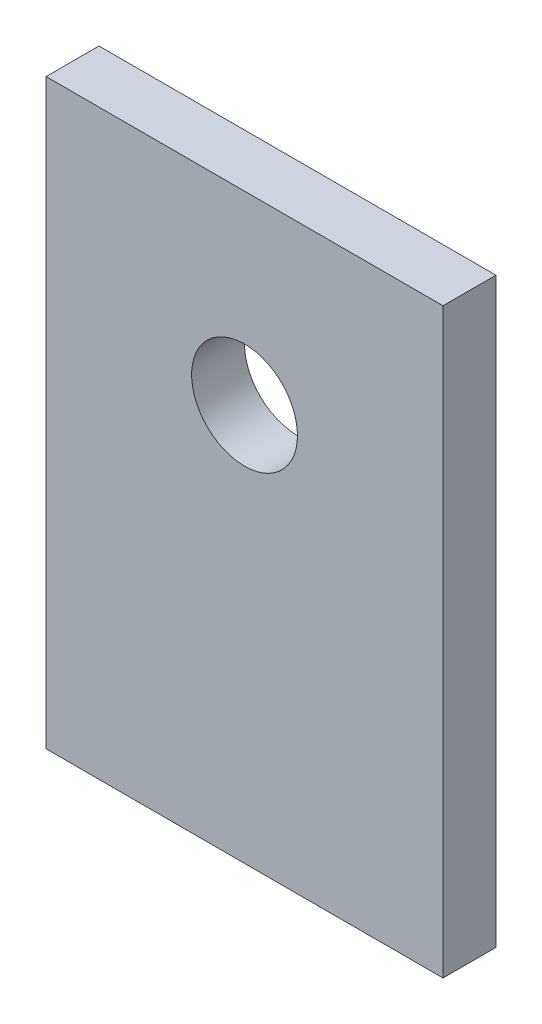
ISO-10303-21;
HEADER;
FILE_DESCRIPTION(('STEP AP214'),'2;1');
FILE_NAME('part.step','',(''),(''),'','','');
FILE_SCHEMA(('AUTOMOTIVE_DESIGN { 1 0 10303 214 1 1 1 1 }'));
ENDSEC;
DATA;
#1=APPLICATION_CONTEXT('core data for automotive mechanical design processes');
#2=APPLICATION_PROTOCOL_DEFINITION('international standard','automotive_design',2000,#1);
#3=PRODUCT_CONTEXT('',#1,'mechanical');
#4=PRODUCT('Part','Part','',(#3));
#5=PRODUCT_RELATED_PRODUCT_CATEGORY('part','',(#4));
#6=PRODUCT_DEFINITION_FORMATION('','',#4);
#7=PRODUCT_DEFINITION_CONTEXT('part definition',#1,'design');
#8=PRODUCT_DEFINITION('design','',#6,#7);
#9=PRODUCT_DEFINITION_SHAPE('','',#8);
#10=(LENGTH_UNIT() NAMED_UNIT(*) SI_UNIT(.MILLI.,.METRE.));
#11=(NAMED_UNIT(*) PLANE_ANGLE_UNIT() SI_UNIT($,.RADIAN.));
#12=(NAMED_UNIT(*) SI_UNIT($,.STERADIAN.) SOLID_ANGLE_UNIT());
#13=UNCERTAINTY_MEASURE_WITH_UNIT(LENGTH_MEASURE(1.E-05),#10,'distance_accuracy_value','');
#14=(GEOMETRIC_REPRESENTATION_CONTEXT(3) GLOBAL_UNCERTAINTY_ASSIGNED_CONTEXT((#13)) GLOBAL_UNIT_ASSIGNED_CONTEXT((#10,
#11,#12)) REPRESENTATION_CONTEXT('',''));
#15=CARTESIAN_POINT('',(0.,0.,0.));
#16=DIRECTION('',(0.,0.,1.));
#17=DIRECTION('',(1.,0.,0.));
#18=AXIS2_PLACEMENT_3D('',#15,#16,#17);
#19=CARTESIAN_POINT('',(0.,110.,20.));
#20=DIRECTION('',(0.,0.,1.));
#21=DIRECTION('',(1.,0.,0.));
#22=AXIS2_PLACEMENT_3D('',#19,#20,#21);
#23=PLANE('',#22);
#24=CARTESIAN_POINT('',(0.,150.,20.));
#25=DIRECTION('',(0.,0.,1.));
#26=DIRECTION('',(1.,0.,0.));
#27=AXIS2_PLACEMENT_3D('',#24,#25,#26);
#28=CIRCLE('',#27,20.);
#29=CARTESIAN_POINT('',(20.,150.,20.));
#30=VERTEX_POINT('',#29);
#31=EDGE_CURVE('E24',#30,#30,#28,.T.);
#32=ORIENTED_EDGE('',*,*,#31,.F.);
#33=EDGE_LOOP('',(#32));
#34=FACE_BOUND('',#33,.T.);
#35=DIRECTION('',(1.,0.,0.));
#36=VECTOR('',#35,1.);
#37=CARTESIAN_POINT('',(-75.,0.,20.));
#38=LINE('',#37,#36);
#39=CARTESIAN_POINT('',(-75.,0.,20.));
#40=VERTEX_POINT('',#39);
#41=CARTESIAN_POINT('',(75.,0.,20.));
#42=VERTEX_POINT('',#41);
#43=EDGE_CURVE('E96',#40,#42,#38,.T.);
#44=ORIENTED_EDGE('',*,*,#43,.T.);
#45=DIRECTION('',(0.,1.,0.));
#46=VECTOR('',#45,1.);
#47=CARTESIAN_POINT('',(75.,0.,20.));
#48=LINE('',#47,#46);
#49=CARTESIAN_POINT('',(75.,220.,20.));
#50=VERTEX_POINT('',#49);
#51=EDGE_CURVE('E112',#42,#50,#48,.T.);
#52=ORIENTED_EDGE('',*,*,#51,.T.);
#53=DIRECTION('',(-1.,0.,0.));
#54=VECTOR('',#53,1.);
#55=CARTESIAN_POINT('',(75.,220.,20.));
#56=LINE('',#55,#54);
#57=CARTESIAN_POINT('',(-75.,220.,20.));
#58=VERTEX_POINT('',#57);
#59=EDGE_CURVE('E88',#50,#58,#56,.T.);
#60=ORIENTED_EDGE('',*,*,#59,.T.);
#61=DIRECTION('',(0.,-1.,0.));
#62=VECTOR('',#61,1.);
#63=CARTESIAN_POINT('',(-75.,220.,20.));
#64=LINE('',#63,#62);
#65=EDGE_CURVE('E87',#58,#40,#64,.T.);
#66=ORIENTED_EDGE('',*,*,#65,.T.);
#67=EDGE_LOOP('',(#44,#52,#60,#66));
#68=FACE_BOUND('',#67,.T.);
#69=ADVANCED_FACE('F16',(#34,#68),#23,.T.);
#70=CARTESIAN_POINT('',(0.,110.,0.));
#71=DIRECTION('',(0.,0.,1.));
#72=DIRECTION('',(1.,0.,0.));
#73=AXIS2_PLACEMENT_3D('',#70,#71,#72);
#74=PLANE('',#73);
#75=CARTESIAN_POINT('',(0.,150.,0.));
#76=DIRECTION('',(0.,0.,1.));
#77=DIRECTION('',(1.,0.,0.));
#78=AXIS2_PLACEMENT_3D('',#75,#76,#77);
#79=CIRCLE('',#78,20.);
#80=CARTESIAN_POINT('',(20.,150.,0.));
#81=VERTEX_POINT('',#80);
#82=EDGE_CURVE('E10',#81,#81,#79,.T.);
#83=ORIENTED_EDGE('',*,*,#82,.T.);
#84=EDGE_LOOP('',(#83));
#85=FACE_BOUND('',#84,.T.);
#86=DIRECTION('',(0.,-1.,0.));
#87=VECTOR('',#86,1.);
#88=CARTESIAN_POINT('',(-75.,220.,0.));
#89=LINE('',#88,#87);
#90=CARTESIAN_POINT('',(-75.,220.,0.));
#91=VERTEX_POINT('',#90);
#92=CARTESIAN_POINT('',(-75.,0.,0.));
#93=VERTEX_POINT('',#92);
#94=EDGE_CURVE('E76',#91,#93,#89,.T.);
#95=ORIENTED_EDGE('',*,*,#94,.F.);
#96=DIRECTION('',(-1.,0.,0.));
#97=VECTOR('',#96,1.);
#98=CARTESIAN_POINT('',(75.,220.,0.));
#99=LINE('',#98,#97);
#100=CARTESIAN_POINT('',(75.,220.,0.));
#101=VERTEX_POINT('',#100);
#102=EDGE_CURVE('E111',#101,#91,#99,.T.);
#103=ORIENTED_EDGE('',*,*,#102,.F.);
#104=DIRECTION('',(0.,1.,0.));
#105=VECTOR('',#104,1.);
#106=CARTESIAN_POINT('',(75.,0.,0.));
#107=LINE('',#106,#105);
#108=CARTESIAN_POINT('',(75.,0.,0.));
#109=VERTEX_POINT('',#108);
#110=EDGE_CURVE('E98',#109,#101,#107,.T.);
#111=ORIENTED_EDGE('',*,*,#110,.F.);
#112=DIRECTION('',(1.,0.,0.));
#113=VECTOR('',#112,1.);
#114=CARTESIAN_POINT('',(-75.,0.,0.));
#115=LINE('',#114,#113);
#116=EDGE_CURVE('E94',#93,#109,#115,.T.);
#117=ORIENTED_EDGE('',*,*,#116,.F.);
#118=EDGE_LOOP('',(#95,#103,#111,#117));
#119=FACE_BOUND('',#118,.T.);
#120=ADVANCED_FACE('F100',(#85,#119),#74,.F.);
#121=CARTESIAN_POINT('',(0.,150.,0.));
#122=DIRECTION('',(0.,0.,-1.));
#123=DIRECTION('',(1.,0.,0.));
#124=AXIS2_PLACEMENT_3D('',#121,#122,#123);
#125=CYLINDRICAL_SURFACE('',#124,20.);
#126=DIRECTION('',(0.,0.,1.));
#127=VECTOR('',#126,1.);
#128=CARTESIAN_POINT('',(20.,150.,0.));
#129=LINE('',#128,#127);
#130=EDGE_CURVE('E117',#81,#30,#129,.T.);
#131=ORIENTED_EDGE('',*,*,#130,.T.);
#132=ORIENTED_EDGE('',*,*,#31,.T.);
#133=ORIENTED_EDGE('',*,*,#130,.F.);
#134=ORIENTED_EDGE('',*,*,#82,.F.);
#135=EDGE_LOOP('',(#131,#132,#133,#134));
#136=FACE_BOUND('',#135,.T.);
#137=ADVANCED_FACE('F136',(#136),#125,.F.);
#138=CARTESIAN_POINT('',(-75.,220.,0.));
#139=DIRECTION('',(1.,0.,0.));
#140=DIRECTION('',(0.,1.,0.));
#141=AXIS2_PLACEMENT_3D('',#138,#139,#140);
#142=PLANE('',#141);
#143=ORIENTED_EDGE('',*,*,#94,.T.);
#144=DIRECTION('',(0.,0.,1.));
#145=VECTOR('',#144,1.);
#146=CARTESIAN_POINT('',(-75.,0.,0.));
#147=LINE('',#146,#145);
#148=EDGE_CURVE('E79',#93,#40,#147,.T.);
#149=ORIENTED_EDGE('',*,*,#148,.T.);
#150=ORIENTED_EDGE('',*,*,#65,.F.);
#151=DIRECTION('',(0.,0.,1.));
#152=VECTOR('',#151,1.);
#153=CARTESIAN_POINT('',(-75.,220.,0.));
#154=LINE('',#153,#152);
#155=EDGE_CURVE('E82',#91,#58,#154,.T.);
#156=ORIENTED_EDGE('',*,*,#155,.F.);
#157=EDGE_LOOP('',(#143,#149,#150,#156));
#158=FACE_BOUND('',#157,.T.);
#159=ADVANCED_FACE('F78',(#158),#142,.F.);
#160=CARTESIAN_POINT('',(75.,220.,0.));
#161=DIRECTION('',(0.,-1.,0.));
#162=DIRECTION('',(0.,0.,-1.));
#163=AXIS2_PLACEMENT_3D('',#160,#161,#162);
#164=PLANE('',#163);
#165=ORIENTED_EDGE('',*,*,#102,.T.);
#166=ORIENTED_EDGE('',*,*,#155,.T.);
#167=ORIENTED_EDGE('',*,*,#59,.F.);
#168=DIRECTION('',(0.,0.,1.));
#169=VECTOR('',#168,1.);
#170=CARTESIAN_POINT('',(75.,220.,0.));
#171=LINE('',#170,#169);
#172=EDGE_CURVE('E122',#101,#50,#171,.T.);
#173=ORIENTED_EDGE('',*,*,#172,.F.);
#174=EDGE_LOOP('',(#165,#166,#167,#173));
#175=FACE_BOUND('',#174,.T.);
#176=ADVANCED_FACE('F143',(#175),#164,.F.);
#177=CARTESIAN_POINT('',(75.,0.,0.));
#178=DIRECTION('',(-1.,0.,0.));
#179=DIRECTION('',(0.,0.,1.));
#180=AXIS2_PLACEMENT_3D('',#177,#178,#179);
#181=PLANE('',#180);
#182=ORIENTED_EDGE('',*,*,#110,.T.);
#183=ORIENTED_EDGE('',*,*,#172,.T.);
#184=ORIENTED_EDGE('',*,*,#51,.F.);
#185=DIRECTION('',(0.,0.,1.));
#186=VECTOR('',#185,1.);
#187=CARTESIAN_POINT('',(75.,0.,0.));
#188=LINE('',#187,#186);
#189=EDGE_CURVE('E104',#109,#42,#188,.T.);
#190=ORIENTED_EDGE('',*,*,#189,.F.);
#191=EDGE_LOOP('',(#182,#183,#184,#190));
#192=FACE_BOUND('',#191,.T.);
#193=ADVANCED_FACE('F152',(#192),#181,.F.);
#194=CARTESIAN_POINT('',(-75.,0.,0.));
#195=DIRECTION('',(0.,1.,0.));
#196=DIRECTION('',(1.,0.,0.));
#197=AXIS2_PLACEMENT_3D('',#194,#195,#196);
#198=PLANE('',#197);
#199=ORIENTED_EDGE('',*,*,#116,.T.);
#200=ORIENTED_EDGE('',*,*,#189,.T.);
#201=ORIENTED_EDGE('',*,*,#43,.F.);
#202=ORIENTED_EDGE('',*,*,#148,.F.);
#203=EDGE_LOOP('',(#199,#200,#201,#202));
#204=FACE_BOUND('',#203,.T.);
#205=ADVANCED_FACE('F92',(#204),#198,.F.);
#206=CLOSED_SHELL('',(#69,#120,#137,#159,#176,#193,#205));
#207=MANIFOLD_SOLID_BREP('B1',#206);
#208=ADVANCED_BREP_SHAPE_REPRESENTATION('',(#18,#207),#14);
#209=SHAPE_DEFINITION_REPRESENTATION(#9,#208);
ENDSEC;
END-ISO-10303-21;
